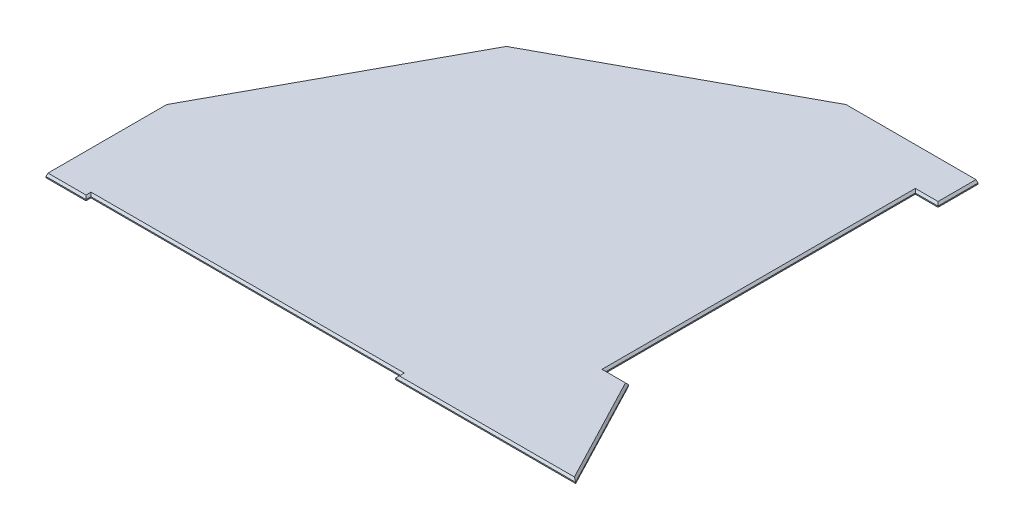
ISO-10303-21;
HEADER;
FILE_DESCRIPTION(('STEP AP214'),'2;1');
FILE_NAME('part.step','',(''),(''),'','','');
FILE_SCHEMA(('AUTOMOTIVE_DESIGN { 1 0 10303 214 1 1 1 1 }'));
ENDSEC;
DATA;
#1=APPLICATION_CONTEXT('core data for automotive mechanical design processes');
#2=APPLICATION_PROTOCOL_DEFINITION('international standard','automotive_design',2000,#1);
#3=PRODUCT_CONTEXT('',#1,'mechanical');
#4=PRODUCT('Part','Part','',(#3));
#5=PRODUCT_RELATED_PRODUCT_CATEGORY('part','',(#4));
#6=PRODUCT_DEFINITION_FORMATION('','',#4);
#7=PRODUCT_DEFINITION_CONTEXT('part definition',#1,'design');
#8=PRODUCT_DEFINITION('design','',#6,#7);
#9=PRODUCT_DEFINITION_SHAPE('','',#8);
#10=(LENGTH_UNIT() NAMED_UNIT(*) SI_UNIT(.MILLI.,.METRE.));
#11=(NAMED_UNIT(*) PLANE_ANGLE_UNIT() SI_UNIT($,.RADIAN.));
#12=(NAMED_UNIT(*) SI_UNIT($,.STERADIAN.) SOLID_ANGLE_UNIT());
#13=UNCERTAINTY_MEASURE_WITH_UNIT(LENGTH_MEASURE(1.E-05),#10,'distance_accuracy_value','');
#14=(GEOMETRIC_REPRESENTATION_CONTEXT(3) GLOBAL_UNCERTAINTY_ASSIGNED_CONTEXT((#13)) GLOBAL_UNIT_ASSIGNED_CONTEXT((#10,
#11,#12)) REPRESENTATION_CONTEXT('',''));
#15=CARTESIAN_POINT('',(0.,0.,0.));
#16=DIRECTION('',(0.,0.,1.));
#17=DIRECTION('',(1.,0.,0.));
#18=AXIS2_PLACEMENT_3D('',#15,#16,#17);
#19=CARTESIAN_POINT('',(145.16828136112,6.35,-591.552652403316));
#20=DIRECTION('',(0.476973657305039,0.,0.878917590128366));
#21=DIRECTION('',(0.878917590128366,0.,-0.476973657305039));
#22=AXIS2_PLACEMENT_3D('',#19,#20,#21);
#23=PLANE('',#22);
#24=DIRECTION('',(-0.878917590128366,0.,0.476973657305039));
#25=VECTOR('',#24,1.);
#26=CARTESIAN_POINT('',(145.16828136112,-6.35,-591.552652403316));
#27=LINE('',#26,#25);
#28=CARTESIAN_POINT('',(145.16828136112,-6.35,-591.552652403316));
#29=VERTEX_POINT('',#28);
#30=CARTESIAN_POINT('',(-405.744758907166,-6.35,-292.581496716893));
#31=VERTEX_POINT('',#30);
#32=EDGE_CURVE('E243',#29,#31,#27,.T.);
#33=ORIENTED_EDGE('',*,*,#32,.T.);
#34=DIRECTION('',(0.,-1.,0.));
#35=VECTOR('',#34,1.);
#36=CARTESIAN_POINT('',(-405.744758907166,6.35,-292.581496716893));
#37=LINE('',#36,#35);
#38=CARTESIAN_POINT('',(-405.744758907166,6.35,-292.581496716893));
#39=VERTEX_POINT('',#38);
#40=EDGE_CURVE('E225',#39,#31,#37,.T.);
#41=ORIENTED_EDGE('',*,*,#40,.F.);
#42=DIRECTION('',(-0.878917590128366,0.,0.476973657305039));
#43=VECTOR('',#42,1.);
#44=CARTESIAN_POINT('',(145.16828136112,6.35,-591.552652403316));
#45=LINE('',#44,#43);
#46=CARTESIAN_POINT('',(145.16828136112,6.35,-591.552652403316));
#47=VERTEX_POINT('',#46);
#48=EDGE_CURVE('E226',#47,#39,#45,.T.);
#49=ORIENTED_EDGE('',*,*,#48,.F.);
#50=DIRECTION('',(0.,-1.,0.));
#51=VECTOR('',#50,1.);
#52=CARTESIAN_POINT('',(145.16828136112,6.35,-591.552652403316));
#53=LINE('',#52,#51);
#54=EDGE_CURVE('E465',#47,#29,#53,.T.);
#55=ORIENTED_EDGE('',*,*,#54,.T.);
#56=EDGE_LOOP('',(#33,#41,#49,#55));
#57=FACE_BOUND('',#56,.T.);
#58=ADVANCED_FACE('F50',(#57),#23,.F.);
#59=CARTESIAN_POINT('',(-405.744758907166,6.35,-292.581496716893));
#60=DIRECTION('',(0.878917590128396,0.,0.476973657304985));
#61=DIRECTION('',(0.476973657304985,0.,-0.878917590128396));
#62=AXIS2_PLACEMENT_3D('',#59,#60,#61);
#63=PLANE('',#62);
#64=DIRECTION('',(-0.476973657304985,0.,0.878917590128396));
#65=VECTOR('',#64,1.);
#66=CARTESIAN_POINT('',(-405.744758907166,-6.35,-292.581496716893));
#67=LINE('',#66,#65);
#68=CARTESIAN_POINT('',(-704.715914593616,-6.35,258.331543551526));
#69=VERTEX_POINT('',#68);
#70=EDGE_CURVE('E471',#31,#69,#67,.T.);
#71=ORIENTED_EDGE('',*,*,#70,.T.);
#72=DIRECTION('',(0.,-1.,0.));
#73=VECTOR('',#72,1.);
#74=CARTESIAN_POINT('',(-704.715914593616,6.35,258.331543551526));
#75=LINE('',#74,#73);
#76=CARTESIAN_POINT('',(-704.715914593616,6.35,258.331543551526));
#77=VERTEX_POINT('',#76);
#78=EDGE_CURVE('E223',#77,#69,#75,.T.);
#79=ORIENTED_EDGE('',*,*,#78,.F.);
#80=DIRECTION('',(-0.476973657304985,0.,0.878917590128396));
#81=VECTOR('',#80,1.);
#82=CARTESIAN_POINT('',(-405.744758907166,6.35,-292.581496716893));
#83=LINE('',#82,#81);
#84=EDGE_CURVE('E217',#39,#77,#83,.T.);
#85=ORIENTED_EDGE('',*,*,#84,.F.);
#86=ORIENTED_EDGE('',*,*,#40,.T.);
#87=EDGE_LOOP('',(#71,#79,#85,#86));
#88=FACE_BOUND('',#87,.T.);
#89=ADVANCED_FACE('F219',(#88),#63,.F.);
#90=CARTESIAN_POINT('',(-704.715914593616,6.35,560.23764759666));
#91=DIRECTION('',(1.,0.,0.));
#92=DIRECTION('',(0.,0.,-1.));
#93=AXIS2_PLACEMENT_3D('',#90,#91,#92);
#94=PLANE('',#93);
#95=DIRECTION('',(0.,0.,1.));
#96=VECTOR('',#95,1.);
#97=CARTESIAN_POINT('',(-704.715914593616,-6.35,560.23764759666));
#98=LINE('',#97,#96);
#99=CARTESIAN_POINT('',(-704.715914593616,-6.35,555.237647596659));
#100=VERTEX_POINT('',#99);
#101=EDGE_CURVE('E478',#69,#100,#98,.T.);
#102=ORIENTED_EDGE('',*,*,#101,.T.);
#103=DIRECTION('',(0.,0.707106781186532,0.707106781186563));
#104=VECTOR('',#103,1.);
#105=CARTESIAN_POINT('',(-704.715914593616,-1.34999999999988,560.23764759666));
#106=LINE('',#105,#104);
#107=CARTESIAN_POINT('',(-704.715914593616,-1.34999999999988,560.23764759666));
#108=VERTEX_POINT('',#107);
#109=EDGE_CURVE('E292',#100,#108,#106,.T.);
#110=ORIENTED_EDGE('',*,*,#109,.T.);
#111=DIRECTION('',(0.,-1.,0.));
#112=VECTOR('',#111,1.);
#113=CARTESIAN_POINT('',(-704.715914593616,6.35,560.23764759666));
#114=LINE('',#113,#112);
#115=CARTESIAN_POINT('',(-704.715914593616,1.35000000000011,560.23764759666));
#116=VERTEX_POINT('',#115);
#117=EDGE_CURVE('E253',#116,#108,#114,.T.);
#118=ORIENTED_EDGE('',*,*,#117,.F.);
#119=DIRECTION('',(0.,-0.707106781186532,0.707106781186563));
#120=VECTOR('',#119,1.);
#121=CARTESIAN_POINT('',(-704.715914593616,6.35,555.23764759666));
#122=LINE('',#121,#120);
#123=CARTESIAN_POINT('',(-704.715914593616,6.35,555.23764759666));
#124=VERTEX_POINT('',#123);
#125=EDGE_CURVE('E286',#116,#124,#122,.F.);
#126=ORIENTED_EDGE('',*,*,#125,.T.);
#127=DIRECTION('',(0.,0.,1.));
#128=VECTOR('',#127,1.);
#129=CARTESIAN_POINT('',(-704.715914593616,6.35,560.23764759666));
#130=LINE('',#129,#128);
#131=EDGE_CURVE('E229',#77,#124,#130,.T.);
#132=ORIENTED_EDGE('',*,*,#131,.F.);
#133=ORIENTED_EDGE('',*,*,#78,.T.);
#134=EDGE_LOOP('',(#102,#110,#118,#126,#132,#133));
#135=FACE_BOUND('',#134,.T.);
#136=ADVANCED_FACE('F614',(#135),#94,.F.);
#137=CARTESIAN_POINT('',(-604.715914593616,6.35,560.23764759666));
#138=DIRECTION('',(0.,0.,-1.));
#139=DIRECTION('',(-1.,0.,0.));
#140=AXIS2_PLACEMENT_3D('',#137,#138,#139);
#141=PLANE('',#140);
#142=ORIENTED_EDGE('',*,*,#117,.T.);
#143=DIRECTION('',(1.,0.,0.));
#144=VECTOR('',#143,1.);
#145=CARTESIAN_POINT('',(-604.715914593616,-1.34999999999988,560.23764759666));
#146=LINE('',#145,#144);
#147=CARTESIAN_POINT('',(-604.715914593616,-1.34999999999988,560.23764759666));
#148=VERTEX_POINT('',#147);
#149=EDGE_CURVE('E249',#108,#148,#146,.T.);
#150=ORIENTED_EDGE('',*,*,#149,.T.);
#151=DIRECTION('',(0.,-1.,0.));
#152=VECTOR('',#151,1.);
#153=CARTESIAN_POINT('',(-604.715914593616,6.35,560.23764759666));
#154=LINE('',#153,#152);
#155=CARTESIAN_POINT('',(-604.715914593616,1.35000000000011,560.23764759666));
#156=VERTEX_POINT('',#155);
#157=EDGE_CURVE('E517',#156,#148,#154,.T.);
#158=ORIENTED_EDGE('',*,*,#157,.F.);
#159=DIRECTION('',(-1.,0.,0.));
#160=VECTOR('',#159,1.);
#161=CARTESIAN_POINT('',(-604.715914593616,1.35000000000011,560.23764759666));
#162=LINE('',#161,#160);
#163=EDGE_CURVE('E241',#156,#116,#162,.T.);
#164=ORIENTED_EDGE('',*,*,#163,.T.);
#165=EDGE_LOOP('',(#142,#150,#158,#164));
#166=FACE_BOUND('',#165,.T.);
#167=ADVANCED_FACE('F524',(#166),#141,.F.);
#168=CARTESIAN_POINT('',(-604.715914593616,6.35,547.71264759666));
#169=DIRECTION('',(-1.,0.,0.));
#170=DIRECTION('',(0.,0.,1.));
#171=AXIS2_PLACEMENT_3D('',#168,#169,#170);
#172=PLANE('',#171);
#173=ORIENTED_EDGE('',*,*,#157,.T.);
#174=DIRECTION('',(0.,0.,-1.));
#175=VECTOR('',#174,1.);
#176=CARTESIAN_POINT('',(-604.715914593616,-1.34999999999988,547.71264759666));
#177=LINE('',#176,#175);
#178=CARTESIAN_POINT('',(-604.715914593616,-1.34999999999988,547.71264759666));
#179=VERTEX_POINT('',#178);
#180=EDGE_CURVE('E300',#148,#179,#177,.T.);
#181=ORIENTED_EDGE('',*,*,#180,.T.);
#182=DIRECTION('',(0.,-1.,0.));
#183=VECTOR('',#182,1.);
#184=CARTESIAN_POINT('',(-604.715914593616,6.35,547.71264759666));
#185=LINE('',#184,#183);
#186=CARTESIAN_POINT('',(-604.715914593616,1.35000000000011,547.71264759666));
#187=VERTEX_POINT('',#186);
#188=EDGE_CURVE('E515',#187,#179,#185,.T.);
#189=ORIENTED_EDGE('',*,*,#188,.F.);
#190=DIRECTION('',(0.,0.,1.));
#191=VECTOR('',#190,1.);
#192=CARTESIAN_POINT('',(-604.715914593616,1.35000000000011,547.71264759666));
#193=LINE('',#192,#191);
#194=EDGE_CURVE('E294',#187,#156,#193,.T.);
#195=ORIENTED_EDGE('',*,*,#194,.T.);
#196=EDGE_LOOP('',(#173,#181,#189,#195));
#197=FACE_BOUND('',#196,.T.);
#198=ADVANCED_FACE('F539',(#197),#172,.F.);
#199=CARTESIAN_POINT('',(-604.715914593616,6.35,547.71264759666));
#200=DIRECTION('',(0.,0.,-1.));
#201=DIRECTION('',(-1.,0.,0.));
#202=AXIS2_PLACEMENT_3D('',#199,#200,#201);
#203=PLANE('',#202);
#204=ORIENTED_EDGE('',*,*,#188,.T.);
#205=DIRECTION('',(1.,0.,0.));
#206=VECTOR('',#205,1.);
#207=CARTESIAN_POINT('',(169.284085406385,-1.34999999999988,547.71264759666));
#208=LINE('',#207,#206);
#209=CARTESIAN_POINT('',(169.284085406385,-1.34999999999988,547.71264759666));
#210=VERTEX_POINT('',#209);
#211=EDGE_CURVE('E301',#179,#210,#208,.T.);
#212=ORIENTED_EDGE('',*,*,#211,.T.);
#213=DIRECTION('',(0.,-1.,0.));
#214=VECTOR('',#213,1.);
#215=CARTESIAN_POINT('',(169.284085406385,6.35,547.71264759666));
#216=LINE('',#215,#214);
#217=CARTESIAN_POINT('',(169.284085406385,1.35000000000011,547.71264759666));
#218=VERTEX_POINT('',#217);
#219=EDGE_CURVE('E506',#218,#210,#216,.T.);
#220=ORIENTED_EDGE('',*,*,#219,.F.);
#221=DIRECTION('',(-1.,0.,0.));
#222=VECTOR('',#221,1.);
#223=CARTESIAN_POINT('',(-604.715914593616,1.35000000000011,547.71264759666));
#224=LINE('',#223,#222);
#225=EDGE_CURVE('E296',#218,#187,#224,.T.);
#226=ORIENTED_EDGE('',*,*,#225,.T.);
#227=EDGE_LOOP('',(#204,#212,#220,#226));
#228=FACE_BOUND('',#227,.T.);
#229=ADVANCED_FACE('F542',(#228),#203,.F.);
#230=CARTESIAN_POINT('',(169.284085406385,6.35,547.71264759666));
#231=DIRECTION('',(1.,0.,0.));
#232=DIRECTION('',(0.,0.,-1.));
#233=AXIS2_PLACEMENT_3D('',#230,#231,#232);
#234=PLANE('',#233);
#235=ORIENTED_EDGE('',*,*,#219,.T.);
#236=DIRECTION('',(0.,0.,1.));
#237=VECTOR('',#236,1.);
#238=CARTESIAN_POINT('',(169.284085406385,-1.34999999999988,560.23764759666));
#239=LINE('',#238,#237);
#240=CARTESIAN_POINT('',(169.284085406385,-1.34999999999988,560.23764759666));
#241=VERTEX_POINT('',#240);
#242=EDGE_CURVE('E310',#210,#241,#239,.T.);
#243=ORIENTED_EDGE('',*,*,#242,.T.);
#244=DIRECTION('',(0.,-1.,0.));
#245=VECTOR('',#244,1.);
#246=CARTESIAN_POINT('',(169.284085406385,6.35,560.23764759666));
#247=LINE('',#246,#245);
#248=CARTESIAN_POINT('',(169.284085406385,1.35000000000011,560.23764759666));
#249=VERTEX_POINT('',#248);
#250=EDGE_CURVE('E504',#249,#241,#247,.T.);
#251=ORIENTED_EDGE('',*,*,#250,.F.);
#252=DIRECTION('',(0.,0.,-1.));
#253=VECTOR('',#252,1.);
#254=CARTESIAN_POINT('',(169.284085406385,1.35000000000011,547.71264759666));
#255=LINE('',#254,#253);
#256=EDGE_CURVE('E308',#249,#218,#255,.T.);
#257=ORIENTED_EDGE('',*,*,#256,.T.);
#258=EDGE_LOOP('',(#235,#243,#251,#257));
#259=FACE_BOUND('',#258,.T.);
#260=ADVANCED_FACE('F558',(#259),#234,.F.);
#261=CARTESIAN_POINT('',(620.484085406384,6.35,560.23764759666));
#262=DIRECTION('',(0.,0.,-1.));
#263=DIRECTION('',(-1.,0.,0.));
#264=AXIS2_PLACEMENT_3D('',#261,#262,#263);
#265=PLANE('',#264);
#266=ORIENTED_EDGE('',*,*,#250,.T.);
#267=DIRECTION('',(1.,0.,0.));
#268=VECTOR('',#267,1.);
#269=CARTESIAN_POINT('',(620.484085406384,-1.34999999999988,560.23764759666));
#270=LINE('',#269,#268);
#271=CARTESIAN_POINT('',(620.484085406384,-1.34999999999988,560.23764759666));
#272=VERTEX_POINT('',#271);
#273=EDGE_CURVE('E312',#241,#272,#270,.T.);
#274=ORIENTED_EDGE('',*,*,#273,.T.);
#275=DIRECTION('',(0.,-1.,0.));
#276=VECTOR('',#275,1.);
#277=CARTESIAN_POINT('',(620.484085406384,6.35,560.23764759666));
#278=LINE('',#277,#276);
#279=CARTESIAN_POINT('',(620.484085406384,1.35000000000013,560.23764759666));
#280=VERTEX_POINT('',#279);
#281=EDGE_CURVE('E498',#280,#272,#278,.T.);
#282=ORIENTED_EDGE('',*,*,#281,.F.);
#283=DIRECTION('',(-1.,0.,0.));
#284=VECTOR('',#283,1.);
#285=CARTESIAN_POINT('',(620.484085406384,1.35000000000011,560.23764759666));
#286=LINE('',#285,#284);
#287=EDGE_CURVE('E315',#280,#249,#286,.T.);
#288=ORIENTED_EDGE('',*,*,#287,.T.);
#289=EDGE_LOOP('',(#266,#274,#282,#288));
#290=FACE_BOUND('',#289,.T.);
#291=ADVANCED_FACE('F565',(#290),#265,.F.);
#292=CARTESIAN_POINT('',(620.484085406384,6.35,560.23764759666));
#293=DIRECTION('',(-0.886253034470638,0.,0.463201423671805));
#294=DIRECTION('',(0.463201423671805,0.,0.886253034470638));
#295=AXIS2_PLACEMENT_3D('',#292,#293,#294);
#296=PLANE('',#295);
#297=ORIENTED_EDGE('',*,*,#281,.T.);
#298=DIRECTION('',(-0.463201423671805,0.,-0.886253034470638));
#299=VECTOR('',#298,1.);
#300=CARTESIAN_POINT('',(475.296585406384,-1.34999999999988,282.447347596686));
#301=LINE('',#300,#299);
#302=CARTESIAN_POINT('',(475.296585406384,-1.34999999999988,282.447347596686));
#303=VERTEX_POINT('',#302);
#304=EDGE_CURVE('E352',#272,#303,#301,.T.);
#305=ORIENTED_EDGE('',*,*,#304,.T.);
#306=DIRECTION('',(0.,-1.,0.));
#307=VECTOR('',#306,1.);
#308=CARTESIAN_POINT('',(475.296585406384,6.35,282.447347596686));
#309=LINE('',#308,#307);
#310=CARTESIAN_POINT('',(475.296585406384,1.35000000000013,282.447347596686));
#311=VERTEX_POINT('',#310);
#312=EDGE_CURVE('E497',#311,#303,#309,.T.);
#313=ORIENTED_EDGE('',*,*,#312,.F.);
#314=DIRECTION('',(0.463201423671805,0.,0.886253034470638));
#315=VECTOR('',#314,1.);
#316=CARTESIAN_POINT('',(620.484085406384,1.35000000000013,560.23764759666));
#317=LINE('',#316,#315);
#318=EDGE_CURVE('E346',#311,#280,#317,.T.);
#319=ORIENTED_EDGE('',*,*,#318,.T.);
#320=EDGE_LOOP('',(#297,#305,#313,#319));
#321=FACE_BOUND('',#320,.T.);
#322=ADVANCED_FACE('F578',(#321),#296,.F.);
#323=CARTESIAN_POINT('',(418.496585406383,6.35,282.447347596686));
#324=DIRECTION('',(0.,0.,1.));
#325=DIRECTION('',(1.,0.,0.));
#326=AXIS2_PLACEMENT_3D('',#323,#324,#325);
#327=PLANE('',#326);
#328=ORIENTED_EDGE('',*,*,#312,.T.);
#329=DIRECTION('',(-1.,0.,0.));
#330=VECTOR('',#329,1.);
#331=CARTESIAN_POINT('',(418.496585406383,-1.34999999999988,282.447347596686));
#332=LINE('',#331,#330);
#333=CARTESIAN_POINT('',(418.496585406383,-1.34999999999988,282.447347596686));
#334=VERTEX_POINT('',#333);
#335=EDGE_CURVE('E342',#303,#334,#332,.T.);
#336=ORIENTED_EDGE('',*,*,#335,.T.);
#337=DIRECTION('',(0.,-1.,0.));
#338=VECTOR('',#337,1.);
#339=CARTESIAN_POINT('',(418.496585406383,6.35,282.447347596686));
#340=LINE('',#339,#338);
#341=CARTESIAN_POINT('',(418.496585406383,1.35000000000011,282.447347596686));
#342=VERTEX_POINT('',#341);
#343=EDGE_CURVE('E495',#342,#334,#340,.T.);
#344=ORIENTED_EDGE('',*,*,#343,.F.);
#345=DIRECTION('',(1.,0.,0.));
#346=VECTOR('',#345,1.);
#347=CARTESIAN_POINT('',(418.496585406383,1.35000000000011,282.447347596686));
#348=LINE('',#347,#346);
#349=EDGE_CURVE('E345',#342,#311,#348,.T.);
#350=ORIENTED_EDGE('',*,*,#349,.T.);
#351=EDGE_LOOP('',(#328,#336,#344,#350));
#352=FACE_BOUND('',#351,.T.);
#353=ADVANCED_FACE('F577',(#352),#327,.F.);
#354=CARTESIAN_POINT('',(418.496585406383,6.35,282.447347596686));
#355=DIRECTION('',(-1.,0.,0.));
#356=DIRECTION('',(0.,0.,1.));
#357=AXIS2_PLACEMENT_3D('',#354,#355,#356);
#358=PLANE('',#357);
#359=ORIENTED_EDGE('',*,*,#343,.T.);
#360=DIRECTION('',(0.,0.,-1.));
#361=VECTOR('',#360,1.);
#362=CARTESIAN_POINT('',(418.496585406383,-1.34999999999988,-491.552652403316));
#363=LINE('',#362,#361);
#364=CARTESIAN_POINT('',(418.496585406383,-1.34999999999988,-491.552652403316));
#365=VERTEX_POINT('',#364);
#366=EDGE_CURVE('E339',#334,#365,#363,.T.);
#367=ORIENTED_EDGE('',*,*,#366,.T.);
#368=DIRECTION('',(0.,-1.,0.));
#369=VECTOR('',#368,1.);
#370=CARTESIAN_POINT('',(418.496585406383,6.35,-491.552652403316));
#371=LINE('',#370,#369);
#372=CARTESIAN_POINT('',(418.496585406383,1.35000000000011,-491.552652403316));
#373=VERTEX_POINT('',#372);
#374=EDGE_CURVE('E488',#373,#365,#371,.T.);
#375=ORIENTED_EDGE('',*,*,#374,.F.);
#376=DIRECTION('',(0.,0.,1.));
#377=VECTOR('',#376,1.);
#378=CARTESIAN_POINT('',(418.496585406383,1.35000000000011,282.447347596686));
#379=LINE('',#378,#377);
#380=EDGE_CURVE('E337',#373,#342,#379,.T.);
#381=ORIENTED_EDGE('',*,*,#380,.T.);
#382=EDGE_LOOP('',(#359,#367,#375,#381));
#383=FACE_BOUND('',#382,.T.);
#384=ADVANCED_FACE('F592',(#383),#358,.F.);
#385=CARTESIAN_POINT('',(418.496585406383,6.35,-491.552652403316));
#386=DIRECTION('',(0.,0.,-1.));
#387=DIRECTION('',(-1.,0.,0.));
#388=AXIS2_PLACEMENT_3D('',#385,#386,#387);
#389=PLANE('',#388);
#390=ORIENTED_EDGE('',*,*,#374,.T.);
#391=DIRECTION('',(1.,0.,0.));
#392=VECTOR('',#391,1.);
#393=CARTESIAN_POINT('',(475.296585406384,-1.34999999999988,-491.552652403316));
#394=LINE('',#393,#392);
#395=CARTESIAN_POINT('',(475.296585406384,-1.34999999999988,-491.552652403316));
#396=VERTEX_POINT('',#395);
#397=EDGE_CURVE('E334',#365,#396,#394,.T.);
#398=ORIENTED_EDGE('',*,*,#397,.T.);
#399=DIRECTION('',(0.,-1.,0.));
#400=VECTOR('',#399,1.);
#401=CARTESIAN_POINT('',(475.296585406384,6.35,-491.552652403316));
#402=LINE('',#401,#400);
#403=CARTESIAN_POINT('',(475.296585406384,1.35000000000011,-491.552652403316));
#404=VERTEX_POINT('',#403);
#405=EDGE_CURVE('E482',#404,#396,#402,.T.);
#406=ORIENTED_EDGE('',*,*,#405,.F.);
#407=DIRECTION('',(-1.,0.,0.));
#408=VECTOR('',#407,1.);
#409=CARTESIAN_POINT('',(418.496585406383,1.35000000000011,-491.552652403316));
#410=LINE('',#409,#408);
#411=EDGE_CURVE('E329',#404,#373,#410,.T.);
#412=ORIENTED_EDGE('',*,*,#411,.T.);
#413=EDGE_LOOP('',(#390,#398,#406,#412));
#414=FACE_BOUND('',#413,.T.);
#415=ADVANCED_FACE('F600',(#414),#389,.F.);
#416=CARTESIAN_POINT('',(475.296585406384,6.35,-491.552652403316));
#417=DIRECTION('',(-1.,0.,0.));
#418=DIRECTION('',(0.,0.,1.));
#419=AXIS2_PLACEMENT_3D('',#416,#417,#418);
#420=PLANE('',#419);
#421=ORIENTED_EDGE('',*,*,#405,.T.);
#422=DIRECTION('',(0.,0.,-1.));
#423=VECTOR('',#422,1.);
#424=CARTESIAN_POINT('',(475.296585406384,-1.34999999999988,-591.552652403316));
#425=LINE('',#424,#423);
#426=CARTESIAN_POINT('',(475.296585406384,-1.34999999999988,-591.552652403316));
#427=VERTEX_POINT('',#426);
#428=EDGE_CURVE('E321',#396,#427,#425,.T.);
#429=ORIENTED_EDGE('',*,*,#428,.T.);
#430=DIRECTION('',(0.,-1.,0.));
#431=VECTOR('',#430,1.);
#432=CARTESIAN_POINT('',(475.296585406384,6.35,-591.552652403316));
#433=LINE('',#432,#431);
#434=CARTESIAN_POINT('',(475.296585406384,1.35000000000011,-591.552652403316));
#435=VERTEX_POINT('',#434);
#436=EDGE_CURVE('E470',#435,#427,#433,.T.);
#437=ORIENTED_EDGE('',*,*,#436,.F.);
#438=DIRECTION('',(0.,0.,1.));
#439=VECTOR('',#438,1.);
#440=CARTESIAN_POINT('',(475.296585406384,1.35000000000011,-491.552652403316));
#441=LINE('',#440,#439);
#442=EDGE_CURVE('E318',#435,#404,#441,.T.);
#443=ORIENTED_EDGE('',*,*,#442,.T.);
#444=EDGE_LOOP('',(#421,#429,#437,#443));
#445=FACE_BOUND('',#444,.T.);
#446=ADVANCED_FACE('F606',(#445),#420,.F.);
#447=CARTESIAN_POINT('',(475.296585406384,6.35,-591.552652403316));
#448=DIRECTION('',(0.,0.,1.));
#449=DIRECTION('',(1.,0.,0.));
#450=AXIS2_PLACEMENT_3D('',#447,#448,#449);
#451=PLANE('',#450);
#452=ORIENTED_EDGE('',*,*,#436,.T.);
#453=DIRECTION('',(-0.707106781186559,-0.707106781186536,0.));
#454=VECTOR('',#453,1.);
#455=CARTESIAN_POINT('',(475.296585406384,-1.34999999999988,-591.552652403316));
#456=LINE('',#455,#454);
#457=CARTESIAN_POINT('',(470.296585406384,-6.35,-591.552652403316));
#458=VERTEX_POINT('',#457);
#459=EDGE_CURVE('E330',#427,#458,#456,.T.);
#460=ORIENTED_EDGE('',*,*,#459,.T.);
#461=DIRECTION('',(-1.,0.,0.));
#462=VECTOR('',#461,1.);
#463=CARTESIAN_POINT('',(475.296585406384,-6.35,-591.552652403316));
#464=LINE('',#463,#462);
#465=EDGE_CURVE('E238',#458,#29,#464,.T.);
#466=ORIENTED_EDGE('',*,*,#465,.T.);
#467=ORIENTED_EDGE('',*,*,#54,.F.);
#468=DIRECTION('',(-1.,0.,0.));
#469=VECTOR('',#468,1.);
#470=CARTESIAN_POINT('',(475.296585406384,6.35,-591.552652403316));
#471=LINE('',#470,#469);
#472=CARTESIAN_POINT('',(470.296585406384,6.35,-591.552652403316));
#473=VERTEX_POINT('',#472);
#474=EDGE_CURVE('E232',#473,#47,#471,.T.);
#475=ORIENTED_EDGE('',*,*,#474,.F.);
#476=DIRECTION('',(-0.707106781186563,0.707106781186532,0.));
#477=VECTOR('',#476,1.);
#478=CARTESIAN_POINT('',(470.296585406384,6.35,-591.552652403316));
#479=LINE('',#478,#477);
#480=EDGE_CURVE('E322',#473,#435,#479,.F.);
#481=ORIENTED_EDGE('',*,*,#480,.T.);
#482=EDGE_LOOP('',(#452,#460,#466,#467,#475,#481));
#483=FACE_BOUND('',#482,.T.);
#484=ADVANCED_FACE('F458',(#483),#451,.F.);
#485=CARTESIAN_POINT('',(0.,6.35,0.));
#486=DIRECTION('',(0.,-1.,0.));
#487=DIRECTION('',(0.,0.,-1.));
#488=AXIS2_PLACEMENT_3D('',#485,#486,#487);
#489=PLANE('',#488);
#490=ORIENTED_EDGE('',*,*,#131,.T.);
#491=DIRECTION('',(1.,0.,0.));
#492=VECTOR('',#491,1.);
#493=CARTESIAN_POINT('',(0.,6.35,555.23764759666));
#494=LINE('',#493,#492);
#495=CARTESIAN_POINT('',(-609.715914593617,6.35,555.23764759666));
#496=VERTEX_POINT('',#495);
#497=EDGE_CURVE('E11',#124,#496,#494,.T.);
#498=ORIENTED_EDGE('',*,*,#497,.T.);
#499=DIRECTION('',(0.,0.,-1.));
#500=VECTOR('',#499,1.);
#501=CARTESIAN_POINT('',(-609.715914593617,6.35,0.));
#502=LINE('',#501,#500);
#503=CARTESIAN_POINT('',(-609.715914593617,6.35,542.71264759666));
#504=VERTEX_POINT('',#503);
#505=EDGE_CURVE('E59',#496,#504,#502,.T.);
#506=ORIENTED_EDGE('',*,*,#505,.T.);
#507=DIRECTION('',(1.,0.,0.));
#508=VECTOR('',#507,1.);
#509=CARTESIAN_POINT('',(0.,6.35,542.71264759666));
#510=LINE('',#509,#508);
#511=CARTESIAN_POINT('',(174.284085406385,6.35,542.71264759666));
#512=VERTEX_POINT('',#511);
#513=EDGE_CURVE('E374',#504,#512,#510,.T.);
#514=ORIENTED_EDGE('',*,*,#513,.T.);
#515=DIRECTION('',(0.,0.,1.));
#516=VECTOR('',#515,1.);
#517=CARTESIAN_POINT('',(174.284085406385,6.35,0.));
#518=LINE('',#517,#516);
#519=CARTESIAN_POINT('',(174.284085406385,6.35,555.23764759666));
#520=VERTEX_POINT('',#519);
#521=EDGE_CURVE('E375',#512,#520,#518,.T.);
#522=ORIENTED_EDGE('',*,*,#521,.T.);
#523=DIRECTION('',(1.,0.,0.));
#524=VECTOR('',#523,1.);
#525=CARTESIAN_POINT('',(0.,6.35,555.23764759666));
#526=LINE('',#525,#524);
#527=CARTESIAN_POINT('',(612.229098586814,6.35,555.23764759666));
#528=VERTEX_POINT('',#527);
#529=EDGE_CURVE('E369',#520,#528,#526,.T.);
#530=ORIENTED_EDGE('',*,*,#529,.T.);
#531=DIRECTION('',(-0.463201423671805,0.,-0.886253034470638));
#532=VECTOR('',#531,1.);
#533=CARTESIAN_POINT('',(252.939299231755,6.35,-132.199088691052));
#534=LINE('',#533,#532);
#535=CARTESIAN_POINT('',(472.268112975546,6.35,287.447347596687));
#536=VERTEX_POINT('',#535);
#537=EDGE_CURVE('E354',#528,#536,#534,.T.);
#538=ORIENTED_EDGE('',*,*,#537,.T.);
#539=DIRECTION('',(-1.,0.,0.));
#540=VECTOR('',#539,1.);
#541=CARTESIAN_POINT('',(0.,6.35,287.447347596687));
#542=LINE('',#541,#540);
#543=CARTESIAN_POINT('',(413.496585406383,6.35,287.447347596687));
#544=VERTEX_POINT('',#543);
#545=EDGE_CURVE('E360',#536,#544,#542,.T.);
#546=ORIENTED_EDGE('',*,*,#545,.T.);
#547=DIRECTION('',(0.,0.,-1.));
#548=VECTOR('',#547,1.);
#549=CARTESIAN_POINT('',(413.496585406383,6.35,0.));
#550=LINE('',#549,#548);
#551=CARTESIAN_POINT('',(413.496585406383,6.35,-496.552652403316));
#552=VERTEX_POINT('',#551);
#553=EDGE_CURVE('E357',#544,#552,#550,.T.);
#554=ORIENTED_EDGE('',*,*,#553,.T.);
#555=DIRECTION('',(1.,0.,0.));
#556=VECTOR('',#555,1.);
#557=CARTESIAN_POINT('',(0.,6.35,-496.552652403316));
#558=LINE('',#557,#556);
#559=CARTESIAN_POINT('',(470.296585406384,6.35,-496.552652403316));
#560=VERTEX_POINT('',#559);
#561=EDGE_CURVE('E361',#552,#560,#558,.T.);
#562=ORIENTED_EDGE('',*,*,#561,.T.);
#563=DIRECTION('',(0.,0.,-1.));
#564=VECTOR('',#563,1.);
#565=CARTESIAN_POINT('',(470.296585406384,6.35,0.));
#566=LINE('',#565,#564);
#567=EDGE_CURVE('E368',#560,#473,#566,.T.);
#568=ORIENTED_EDGE('',*,*,#567,.T.);
#569=ORIENTED_EDGE('',*,*,#474,.T.);
#570=ORIENTED_EDGE('',*,*,#48,.T.);
#571=ORIENTED_EDGE('',*,*,#84,.T.);
#572=EDGE_LOOP('',(#490,#498,#506,#514,#522,#530,#538,#546,#554,#562,#568,#569,#570,#571));
#573=FACE_BOUND('',#572,.T.);
#574=ADVANCED_FACE('F231',(#573),#489,.F.);
#575=CARTESIAN_POINT('',(0.,-6.35,0.));
#576=DIRECTION('',(0.,-1.,0.));
#577=DIRECTION('',(0.,0.,-1.));
#578=AXIS2_PLACEMENT_3D('',#575,#576,#577);
#579=PLANE('',#578);
#580=DIRECTION('',(0.,0.,1.));
#581=VECTOR('',#580,1.);
#582=CARTESIAN_POINT('',(-609.715914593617,-6.35,560.23764759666));
#583=LINE('',#582,#581);
#584=CARTESIAN_POINT('',(-609.715914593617,-6.35,542.71264759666));
#585=VERTEX_POINT('',#584);
#586=CARTESIAN_POINT('',(-609.715914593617,-6.35,555.237647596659));
#587=VERTEX_POINT('',#586);
#588=EDGE_CURVE('E285',#585,#587,#583,.T.);
#589=ORIENTED_EDGE('',*,*,#588,.T.);
#590=DIRECTION('',(-1.,0.,0.));
#591=VECTOR('',#590,1.);
#592=CARTESIAN_POINT('',(-704.715914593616,-6.35,555.237647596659));
#593=LINE('',#592,#591);
#594=EDGE_CURVE('E281',#587,#100,#593,.T.);
#595=ORIENTED_EDGE('',*,*,#594,.T.);
#596=ORIENTED_EDGE('',*,*,#101,.F.);
#597=ORIENTED_EDGE('',*,*,#70,.F.);
#598=ORIENTED_EDGE('',*,*,#32,.F.);
#599=ORIENTED_EDGE('',*,*,#465,.F.);
#600=DIRECTION('',(0.,0.,1.));
#601=VECTOR('',#600,1.);
#602=CARTESIAN_POINT('',(470.296585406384,-6.35,-491.552652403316));
#603=LINE('',#602,#601);
#604=CARTESIAN_POINT('',(470.296585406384,-6.35,-496.552652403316));
#605=VERTEX_POINT('',#604);
#606=EDGE_CURVE('E269',#458,#605,#603,.T.);
#607=ORIENTED_EDGE('',*,*,#606,.T.);
#608=DIRECTION('',(-1.,0.,0.));
#609=VECTOR('',#608,1.);
#610=CARTESIAN_POINT('',(418.496585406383,-6.35,-496.552652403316));
#611=LINE('',#610,#609);
#612=CARTESIAN_POINT('',(413.496585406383,-6.35,-496.552652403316));
#613=VERTEX_POINT('',#612);
#614=EDGE_CURVE('E270',#605,#613,#611,.T.);
#615=ORIENTED_EDGE('',*,*,#614,.T.);
#616=DIRECTION('',(0.,0.,1.));
#617=VECTOR('',#616,1.);
#618=CARTESIAN_POINT('',(413.496585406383,-6.35,282.447347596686));
#619=LINE('',#618,#617);
#620=CARTESIAN_POINT('',(413.496585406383,-6.35,287.447347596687));
#621=VERTEX_POINT('',#620);
#622=EDGE_CURVE('E262',#613,#621,#619,.T.);
#623=ORIENTED_EDGE('',*,*,#622,.T.);
#624=DIRECTION('',(1.,0.,0.));
#625=VECTOR('',#624,1.);
#626=CARTESIAN_POINT('',(475.296585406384,-6.35,287.447347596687));
#627=LINE('',#626,#625);
#628=CARTESIAN_POINT('',(472.268112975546,-6.35,287.447347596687));
#629=VERTEX_POINT('',#628);
#630=EDGE_CURVE('E261',#621,#629,#627,.T.);
#631=ORIENTED_EDGE('',*,*,#630,.T.);
#632=DIRECTION('',(0.463201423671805,0.,0.886253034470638));
#633=VECTOR('',#632,1.);
#634=CARTESIAN_POINT('',(616.05282023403,-6.35,562.553654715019));
#635=LINE('',#634,#633);
#636=CARTESIAN_POINT('',(612.229098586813,-6.35,555.237647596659));
#637=VERTEX_POINT('',#636);
#638=EDGE_CURVE('E256',#629,#637,#635,.T.);
#639=ORIENTED_EDGE('',*,*,#638,.T.);
#640=DIRECTION('',(-1.,0.,0.));
#641=VECTOR('',#640,1.);
#642=CARTESIAN_POINT('',(169.284085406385,-6.35,555.237647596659));
#643=LINE('',#642,#641);
#644=CARTESIAN_POINT('',(174.284085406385,-6.35,555.237647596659));
#645=VERTEX_POINT('',#644);
#646=EDGE_CURVE('E272',#637,#645,#643,.T.);
#647=ORIENTED_EDGE('',*,*,#646,.T.);
#648=DIRECTION('',(0.,0.,-1.));
#649=VECTOR('',#648,1.);
#650=CARTESIAN_POINT('',(174.284085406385,-6.35,547.71264759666));
#651=LINE('',#650,#649);
#652=CARTESIAN_POINT('',(174.284085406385,-6.35,542.71264759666));
#653=VERTEX_POINT('',#652);
#654=EDGE_CURVE('E277',#645,#653,#651,.T.);
#655=ORIENTED_EDGE('',*,*,#654,.T.);
#656=DIRECTION('',(-1.,0.,0.));
#657=VECTOR('',#656,1.);
#658=CARTESIAN_POINT('',(-604.715914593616,-6.35,542.71264759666));
#659=LINE('',#658,#657);
#660=EDGE_CURVE('E276',#653,#585,#659,.T.);
#661=ORIENTED_EDGE('',*,*,#660,.T.);
#662=EDGE_LOOP('',(#589,#595,#596,#597,#598,#599,#607,#615,#623,#631,#639,#647,#655,#661));
#663=FACE_BOUND('',#662,.T.);
#664=ADVANCED_FACE('F615',(#663),#579,.T.);
#665=CARTESIAN_POINT('',(475.296585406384,-1.34999999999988,-491.552652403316));
#666=DIRECTION('',(0.707106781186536,-0.707106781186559,0.));
#667=DIRECTION('',(0.,0.,1.));
#668=AXIS2_PLACEMENT_3D('',#665,#666,#667);
#669=PLANE('',#668);
#670=ORIENTED_EDGE('',*,*,#459,.F.);
#671=ORIENTED_EDGE('',*,*,#428,.F.);
#672=DIRECTION('',(0.577350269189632,0.577350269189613,0.577350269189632));
#673=VECTOR('',#672,1.);
#674=CARTESIAN_POINT('',(456.36325207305,-20.2833333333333,-510.48598573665));
#675=LINE('',#674,#673);
#676=EDGE_CURVE('E413',#605,#396,#675,.T.);
#677=ORIENTED_EDGE('',*,*,#676,.F.);
#678=ORIENTED_EDGE('',*,*,#606,.F.);
#679=EDGE_LOOP('',(#670,#671,#677,#678));
#680=FACE_BOUND('',#679,.T.);
#681=ADVANCED_FACE('F610',(#680),#669,.T.);
#682=CARTESIAN_POINT('',(418.496585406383,-1.34999999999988,-491.552652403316));
#683=DIRECTION('',(0.,-0.707106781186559,0.707106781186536));
#684=DIRECTION('',(-1.,0.,0.));
#685=AXIS2_PLACEMENT_3D('',#682,#683,#684);
#686=PLANE('',#685);
#687=ORIENTED_EDGE('',*,*,#676,.T.);
#688=ORIENTED_EDGE('',*,*,#397,.F.);
#689=DIRECTION('',(0.577350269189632,0.577350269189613,0.577350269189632));
#690=VECTOR('',#689,1.);
#691=CARTESIAN_POINT('',(418.496585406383,-1.34999999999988,-491.552652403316));
#692=LINE('',#691,#690);
#693=EDGE_CURVE('E410',#613,#365,#692,.T.);
#694=ORIENTED_EDGE('',*,*,#693,.F.);
#695=ORIENTED_EDGE('',*,*,#614,.F.);
#696=EDGE_LOOP('',(#687,#688,#694,#695));
#697=FACE_BOUND('',#696,.T.);
#698=ADVANCED_FACE('F599',(#697),#686,.T.);
#699=CARTESIAN_POINT('',(418.496585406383,-1.34999999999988,282.447347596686));
#700=DIRECTION('',(0.707106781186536,-0.707106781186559,0.));
#701=DIRECTION('',(0.,0.,1.));
#702=AXIS2_PLACEMENT_3D('',#699,#700,#701);
#703=PLANE('',#702);
#704=ORIENTED_EDGE('',*,*,#693,.T.);
#705=ORIENTED_EDGE('',*,*,#366,.F.);
#706=DIRECTION('',(0.577350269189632,0.577350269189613,-0.577350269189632));
#707=VECTOR('',#706,1.);
#708=CARTESIAN_POINT('',(418.496585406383,-1.34999999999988,282.447347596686));
#709=LINE('',#708,#707);
#710=EDGE_CURVE('E401',#621,#334,#709,.T.);
#711=ORIENTED_EDGE('',*,*,#710,.F.);
#712=ORIENTED_EDGE('',*,*,#622,.F.);
#713=EDGE_LOOP('',(#704,#705,#711,#712));
#714=FACE_BOUND('',#713,.T.);
#715=ADVANCED_FACE('F587',(#714),#703,.T.);
#716=CARTESIAN_POINT('',(418.496585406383,-1.34999999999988,282.447347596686));
#717=DIRECTION('',(0.,-0.707106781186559,-0.707106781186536));
#718=DIRECTION('',(1.,0.,0.));
#719=AXIS2_PLACEMENT_3D('',#716,#717,#718);
#720=PLANE('',#719);
#721=ORIENTED_EDGE('',*,*,#710,.T.);
#722=ORIENTED_EDGE('',*,*,#335,.F.);
#723=DIRECTION('',(0.39370125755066,0.649999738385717,-0.649999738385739));
#724=VECTOR('',#723,1.);
#725=CARTESIAN_POINT('',(426.712621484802,-81.5619963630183,362.659343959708));
#726=LINE('',#725,#724);
#727=EDGE_CURVE('E399',#629,#303,#726,.T.);
#728=ORIENTED_EDGE('',*,*,#727,.F.);
#729=ORIENTED_EDGE('',*,*,#630,.F.);
#730=EDGE_LOOP('',(#721,#722,#728,#729));
#731=FACE_BOUND('',#730,.T.);
#732=ADVANCED_FACE('F585',(#731),#720,.T.);
#733=CARTESIAN_POINT('',(620.484085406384,-1.34999999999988,560.23764759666));
#734=DIRECTION('',(0.626675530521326,-0.707106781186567,-0.327532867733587));
#735=DIRECTION('',(0.463201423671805,0.,0.886253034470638));
#736=AXIS2_PLACEMENT_3D('',#733,#734,#735);
#737=PLANE('',#736);
#738=ORIENTED_EDGE('',*,*,#727,.T.);
#739=ORIENTED_EDGE('',*,*,#304,.F.);
#740=DIRECTION('',(-0.759467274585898,-0.460005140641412,-0.460005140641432));
#741=VECTOR('',#740,1.);
#742=CARTESIAN_POINT('',(620.484085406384,-1.34999999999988,560.23764759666));
#743=LINE('',#742,#741);
#744=EDGE_CURVE('E391',#637,#272,#743,.F.);
#745=ORIENTED_EDGE('',*,*,#744,.F.);
#746=ORIENTED_EDGE('',*,*,#638,.F.);
#747=EDGE_LOOP('',(#738,#739,#745,#746));
#748=FACE_BOUND('',#747,.T.);
#749=ADVANCED_FACE('F575',(#748),#737,.T.);
#750=CARTESIAN_POINT('',(620.484085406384,-1.34999999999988,560.23764759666));
#751=DIRECTION('',(0.,-0.707106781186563,0.707106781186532));
#752=DIRECTION('',(-1.,0.,0.));
#753=AXIS2_PLACEMENT_3D('',#750,#751,#752);
#754=PLANE('',#753);
#755=ORIENTED_EDGE('',*,*,#744,.T.);
#756=ORIENTED_EDGE('',*,*,#273,.F.);
#757=DIRECTION('',(0.577350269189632,-0.57735026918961,-0.577350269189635));
#758=VECTOR('',#757,1.);
#759=CARTESIAN_POINT('',(319.684085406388,-151.749999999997,409.837647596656));
#760=LINE('',#759,#758);
#761=EDGE_CURVE('E392',#645,#241,#760,.F.);
#762=ORIENTED_EDGE('',*,*,#761,.F.);
#763=ORIENTED_EDGE('',*,*,#646,.F.);
#764=EDGE_LOOP('',(#755,#756,#762,#763));
#765=FACE_BOUND('',#764,.T.);
#766=ADVANCED_FACE('F567',(#765),#754,.T.);
#767=CARTESIAN_POINT('',(169.284085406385,-1.34999999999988,547.71264759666));
#768=DIRECTION('',(-0.707106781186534,-0.707106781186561,0.));
#769=DIRECTION('',(0.,0.,-1.));
#770=AXIS2_PLACEMENT_3D('',#767,#768,#769);
#771=PLANE('',#770);
#772=ORIENTED_EDGE('',*,*,#761,.T.);
#773=ORIENTED_EDGE('',*,*,#242,.F.);
#774=DIRECTION('',(0.577350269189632,-0.57735026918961,-0.577350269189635));
#775=VECTOR('',#774,1.);
#776=CARTESIAN_POINT('',(-88.7159145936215,256.649999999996,805.712647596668));
#777=LINE('',#776,#775);
#778=EDGE_CURVE('E390',#653,#210,#777,.F.);
#779=ORIENTED_EDGE('',*,*,#778,.F.);
#780=ORIENTED_EDGE('',*,*,#654,.F.);
#781=EDGE_LOOP('',(#772,#773,#779,#780));
#782=FACE_BOUND('',#781,.T.);
#783=ADVANCED_FACE('F551',(#782),#771,.T.);
#784=CARTESIAN_POINT('',(-604.715914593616,-1.34999999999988,547.71264759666));
#785=DIRECTION('',(0.,-0.707106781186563,0.707106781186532));
#786=DIRECTION('',(-1.,0.,0.));
#787=AXIS2_PLACEMENT_3D('',#784,#785,#786);
#788=PLANE('',#787);
#789=ORIENTED_EDGE('',*,*,#778,.T.);
#790=ORIENTED_EDGE('',*,*,#211,.F.);
#791=DIRECTION('',(-0.577350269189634,-0.577350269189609,-0.577350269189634));
#792=VECTOR('',#791,1.);
#793=CARTESIAN_POINT('',(-604.715914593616,-1.34999999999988,547.71264759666));
#794=LINE('',#793,#792);
#795=EDGE_CURVE('E382',#585,#179,#794,.F.);
#796=ORIENTED_EDGE('',*,*,#795,.F.);
#797=ORIENTED_EDGE('',*,*,#660,.F.);
#798=EDGE_LOOP('',(#789,#790,#796,#797));
#799=FACE_BOUND('',#798,.T.);
#800=ADVANCED_FACE('F547',(#799),#788,.T.);
#801=CARTESIAN_POINT('',(-604.715914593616,-1.34999999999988,547.71264759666));
#802=DIRECTION('',(0.707106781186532,-0.707106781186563,0.));
#803=DIRECTION('',(0.,0.,1.));
#804=AXIS2_PLACEMENT_3D('',#801,#802,#803);
#805=PLANE('',#804);
#806=ORIENTED_EDGE('',*,*,#795,.T.);
#807=ORIENTED_EDGE('',*,*,#180,.F.);
#808=DIRECTION('',(-0.577350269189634,-0.577350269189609,-0.577350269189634));
#809=VECTOR('',#808,1.);
#810=CARTESIAN_POINT('',(-608.890914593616,-5.52499999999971,556.06264759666));
#811=LINE('',#810,#809);
#812=EDGE_CURVE('E379',#587,#148,#811,.F.);
#813=ORIENTED_EDGE('',*,*,#812,.F.);
#814=ORIENTED_EDGE('',*,*,#588,.F.);
#815=EDGE_LOOP('',(#806,#807,#813,#814));
#816=FACE_BOUND('',#815,.T.);
#817=ADVANCED_FACE('F536',(#816),#805,.T.);
#818=CARTESIAN_POINT('',(-604.715914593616,-1.34999999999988,560.23764759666));
#819=DIRECTION('',(0.,-0.707106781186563,0.707106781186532));
#820=DIRECTION('',(-1.,0.,0.));
#821=AXIS2_PLACEMENT_3D('',#818,#819,#820);
#822=PLANE('',#821);
#823=ORIENTED_EDGE('',*,*,#109,.F.);
#824=ORIENTED_EDGE('',*,*,#594,.F.);
#825=ORIENTED_EDGE('',*,*,#812,.T.);
#826=ORIENTED_EDGE('',*,*,#149,.F.);
#827=EDGE_LOOP('',(#823,#824,#825,#826));
#828=FACE_BOUND('',#827,.T.);
#829=ADVANCED_FACE('F529',(#828),#822,.T.);
#830=CARTESIAN_POINT('',(470.296585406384,6.35,0.));
#831=DIRECTION('',(-0.707106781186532,-0.707106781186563,0.));
#832=DIRECTION('',(0.,0.,-1.));
#833=AXIS2_PLACEMENT_3D('',#830,#831,#832);
#834=PLANE('',#833);
#835=ORIENTED_EDGE('',*,*,#480,.F.);
#836=ORIENTED_EDGE('',*,*,#567,.F.);
#837=DIRECTION('',(-0.577350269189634,0.577350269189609,-0.577350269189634));
#838=VECTOR('',#837,1.);
#839=CARTESIAN_POINT('',(313.531056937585,163.115528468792,-653.318180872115));
#840=LINE('',#839,#838);
#841=EDGE_CURVE('E55',#404,#560,#840,.T.);
#842=ORIENTED_EDGE('',*,*,#841,.F.);
#843=ORIENTED_EDGE('',*,*,#442,.F.);
#844=EDGE_LOOP('',(#835,#836,#842,#843));
#845=FACE_BOUND('',#844,.T.);
#846=ADVANCED_FACE('F49',(#845),#834,.F.);
#847=CARTESIAN_POINT('',(0.,6.35,-496.552652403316));
#848=DIRECTION('',(0.,-0.707106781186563,-0.707106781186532));
#849=DIRECTION('',(1.,0.,0.));
#850=AXIS2_PLACEMENT_3D('',#847,#848,#849);
#851=PLANE('',#850);
#852=ORIENTED_EDGE('',*,*,#841,.T.);
#853=ORIENTED_EDGE('',*,*,#561,.F.);
#854=DIRECTION('',(-0.577350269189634,0.577350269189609,-0.577350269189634));
#855=VECTOR('',#854,1.);
#856=CARTESIAN_POINT('',(275.664390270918,144.182195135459,-634.384847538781));
#857=LINE('',#856,#855);
#858=EDGE_CURVE('E439',#373,#552,#857,.T.);
#859=ORIENTED_EDGE('',*,*,#858,.F.);
#860=ORIENTED_EDGE('',*,*,#411,.F.);
#861=EDGE_LOOP('',(#852,#853,#859,#860));
#862=FACE_BOUND('',#861,.T.);
#863=ADVANCED_FACE('F451',(#862),#851,.F.);
#864=CARTESIAN_POINT('',(413.496585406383,6.35,0.));
#865=DIRECTION('',(-0.707106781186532,-0.707106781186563,0.));
#866=DIRECTION('',(0.,0.,-1.));
#867=AXIS2_PLACEMENT_3D('',#864,#865,#866);
#868=PLANE('',#867);
#869=ORIENTED_EDGE('',*,*,#858,.T.);
#870=ORIENTED_EDGE('',*,*,#553,.F.);
#871=DIRECTION('',(-0.577350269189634,0.577350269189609,0.577350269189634));
#872=VECTOR('',#871,1.);
#873=CARTESIAN_POINT('',(509.312367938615,-89.4657825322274,191.631565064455));
#874=LINE('',#873,#872);
#875=EDGE_CURVE('E440',#342,#544,#874,.T.);
#876=ORIENTED_EDGE('',*,*,#875,.F.);
#877=ORIENTED_EDGE('',*,*,#380,.F.);
#878=EDGE_LOOP('',(#869,#870,#876,#877));
#879=FACE_BOUND('',#878,.T.);
#880=ADVANCED_FACE('F636',(#879),#868,.F.);
#881=CARTESIAN_POINT('',(0.,6.35,287.447347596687));
#882=DIRECTION('',(0.,-0.707106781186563,0.707106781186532));
#883=DIRECTION('',(-1.,0.,0.));
#884=AXIS2_PLACEMENT_3D('',#881,#882,#883);
#885=PLANE('',#884);
#886=ORIENTED_EDGE('',*,*,#875,.T.);
#887=ORIENTED_EDGE('',*,*,#545,.F.);
#888=DIRECTION('',(-0.393701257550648,0.649999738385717,0.649999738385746));
#889=VECTOR('',#888,1.);
#890=CARTESIAN_POINT('',(545.661918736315,-114.822979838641,166.27436775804));
#891=LINE('',#890,#889);
#892=EDGE_CURVE('E433',#311,#536,#891,.T.);
#893=ORIENTED_EDGE('',*,*,#892,.F.);
#894=ORIENTED_EDGE('',*,*,#349,.F.);
#895=EDGE_LOOP('',(#886,#887,#893,#894));
#896=FACE_BOUND('',#895,.T.);
#897=ADVANCED_FACE('F638',(#896),#885,.F.);
#898=CARTESIAN_POINT('',(252.939299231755,6.35,-132.199088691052));
#899=DIRECTION('',(-0.626675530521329,-0.707106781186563,0.327532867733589));
#900=DIRECTION('',(-0.463201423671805,0.,-0.886253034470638));
#901=AXIS2_PLACEMENT_3D('',#898,#899,#900);
#902=PLANE('',#901);
#903=ORIENTED_EDGE('',*,*,#892,.T.);
#904=ORIENTED_EDGE('',*,*,#537,.F.);
#905=DIRECTION('',(0.759467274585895,-0.460005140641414,0.460005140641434));
#906=VECTOR('',#905,1.);
#907=CARTESIAN_POINT('',(164.832032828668,277.335935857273,284.251711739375));
#908=LINE('',#907,#906);
#909=EDGE_CURVE('E427',#280,#528,#908,.F.);
#910=ORIENTED_EDGE('',*,*,#909,.F.);
#911=ORIENTED_EDGE('',*,*,#318,.F.);
#912=EDGE_LOOP('',(#903,#904,#910,#911));
#913=FACE_BOUND('',#912,.T.);
#914=ADVANCED_FACE('F631',(#913),#902,.F.);
#915=CARTESIAN_POINT('',(0.,6.35,555.23764759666));
#916=DIRECTION('',(0.,-0.707106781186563,-0.707106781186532));
#917=DIRECTION('',(1.,0.,0.));
#918=AXIS2_PLACEMENT_3D('',#915,#916,#917);
#919=PLANE('',#918);
#920=ORIENTED_EDGE('',*,*,#909,.T.);
#921=ORIENTED_EDGE('',*,*,#529,.F.);
#922=DIRECTION('',(-0.577350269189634,-0.577350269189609,0.577350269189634));
#923=VECTOR('',#922,1.);
#924=CARTESIAN_POINT('',(116.189390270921,-51.7446951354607,613.332342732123));
#925=LINE('',#924,#923);
#926=EDGE_CURVE('E422',#249,#520,#925,.F.);
#927=ORIENTED_EDGE('',*,*,#926,.F.);
#928=ORIENTED_EDGE('',*,*,#287,.F.);
#929=EDGE_LOOP('',(#920,#921,#927,#928));
#930=FACE_BOUND('',#929,.T.);
#931=ADVANCED_FACE('F628',(#930),#919,.F.);
#932=CARTESIAN_POINT('',(174.284085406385,6.35,0.));
#933=DIRECTION('',(0.707106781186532,-0.707106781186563,0.));
#934=DIRECTION('',(0.,0.,1.));
#935=AXIS2_PLACEMENT_3D('',#932,#933,#934);
#936=PLANE('',#935);
#937=ORIENTED_EDGE('',*,*,#926,.T.);
#938=ORIENTED_EDGE('',*,*,#521,.F.);
#939=DIRECTION('',(-0.577350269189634,-0.577350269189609,0.577350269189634));
#940=VECTOR('',#939,1.);
#941=CARTESIAN_POINT('',(116.189390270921,-51.7446951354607,600.807342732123));
#942=LINE('',#941,#940);
#943=EDGE_CURVE('E423',#218,#512,#942,.F.);
#944=ORIENTED_EDGE('',*,*,#943,.F.);
#945=ORIENTED_EDGE('',*,*,#256,.F.);
#946=EDGE_LOOP('',(#937,#938,#944,#945));
#947=FACE_BOUND('',#946,.T.);
#948=ADVANCED_FACE('F623',(#947),#936,.F.);
#949=CARTESIAN_POINT('',(0.,6.35,542.71264759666));
#950=DIRECTION('',(0.,-0.707106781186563,-0.707106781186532));
#951=DIRECTION('',(1.,0.,0.));
#952=AXIS2_PLACEMENT_3D('',#949,#950,#951);
#953=PLANE('',#952);
#954=ORIENTED_EDGE('',*,*,#943,.T.);
#955=ORIENTED_EDGE('',*,*,#513,.F.);
#956=DIRECTION('',(0.577350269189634,-0.577350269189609,0.577350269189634));
#957=VECTOR('',#956,1.);
#958=CARTESIAN_POINT('',(-790.620130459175,187.254215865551,361.808431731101));
#959=LINE('',#958,#957);
#960=EDGE_CURVE('E417',#187,#504,#959,.F.);
#961=ORIENTED_EDGE('',*,*,#960,.F.);
#962=ORIENTED_EDGE('',*,*,#225,.F.);
#963=EDGE_LOOP('',(#954,#955,#961,#962));
#964=FACE_BOUND('',#963,.T.);
#965=ADVANCED_FACE('F617',(#964),#953,.F.);
#966=CARTESIAN_POINT('',(-609.715914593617,6.35,0.));
#967=DIRECTION('',(-0.707106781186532,-0.707106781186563,0.));
#968=DIRECTION('',(0.,0.,-1.));
#969=AXIS2_PLACEMENT_3D('',#966,#967,#968);
#970=PLANE('',#969);
#971=ORIENTED_EDGE('',*,*,#960,.T.);
#972=ORIENTED_EDGE('',*,*,#505,.F.);
#973=DIRECTION('',(0.577350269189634,-0.577350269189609,0.577350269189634));
#974=VECTOR('',#973,1.);
#975=CARTESIAN_POINT('',(-794.795130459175,191.42921586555,370.158431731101));
#976=LINE('',#975,#974);
#977=EDGE_CURVE('E68',#156,#496,#976,.F.);
#978=ORIENTED_EDGE('',*,*,#977,.F.);
#979=ORIENTED_EDGE('',*,*,#194,.F.);
#980=EDGE_LOOP('',(#971,#972,#978,#979));
#981=FACE_BOUND('',#980,.T.);
#982=ADVANCED_FACE('F616',(#981),#970,.F.);
#983=CARTESIAN_POINT('',(0.,6.35,555.23764759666));
#984=DIRECTION('',(0.,-0.707106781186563,-0.707106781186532));
#985=DIRECTION('',(1.,0.,0.));
#986=AXIS2_PLACEMENT_3D('',#983,#984,#985);
#987=PLANE('',#986);
#988=ORIENTED_EDGE('',*,*,#125,.F.);
#989=ORIENTED_EDGE('',*,*,#163,.F.);
#990=ORIENTED_EDGE('',*,*,#977,.T.);
#991=ORIENTED_EDGE('',*,*,#497,.F.);
#992=EDGE_LOOP('',(#988,#989,#990,#991));
#993=FACE_BOUND('',#992,.T.);
#994=ADVANCED_FACE('F611',(#993),#987,.F.);
#995=CLOSED_SHELL('',(#58,#89,#136,#167,#198,#229,#260,#291,#322,#353,#384,#415,#446,#484,#574,
#664,#681,#698,#715,#732,#749,#766,#783,#800,#817,#829,#846,#863,#880,#897,#914,#931,#948,#965,
#982,#994));
#996=MANIFOLD_SOLID_BREP('B2',#995);
#997=ADVANCED_BREP_SHAPE_REPRESENTATION('',(#18,#996),#14);
#998=SHAPE_DEFINITION_REPRESENTATION(#9,#997);
ENDSEC;
END-ISO-10303-21;
